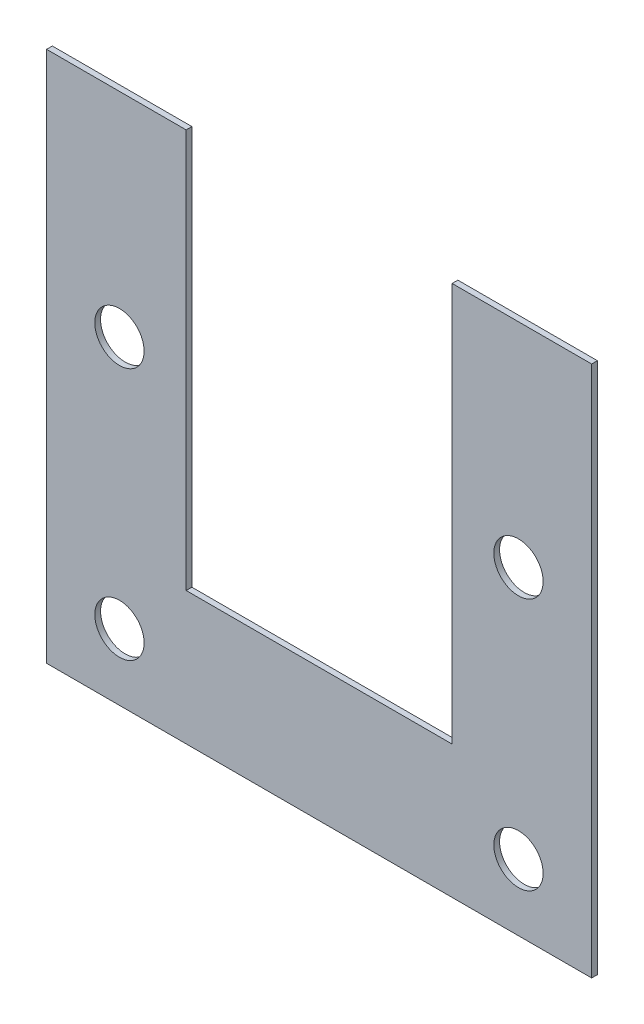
from build123d import *

# Parameters (mm, degrees)
EXTRUDE1_DEPTH       = 0.17145
HOLE1_D              = 2.9464
LPATTERN1_COUNT      = 2
LPATTERN1_PITCH      = 23.8252
LPATTERN1_COUNT_DIR2 = 2
LPATTERN1_PITCH_DIR2 = 15.0876
SKETCH5_W            = 32.54375
SKETCH5_H            = 0.79375
CUT_EXTRUDE2_DEPTH   = 24.014460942


with BuildPart() as part:
    # Sketch1 → Extrude1 (new, symmetric)
    with BuildSketch(Plane.XY):
        Polygon((-16.271875, 16.271875), (-7.940675, 16.271875), (-7.940675, -8.340725), (7.940675, -8.340725), (7.940675, 16.271875), (16.271875, 16.271875), (16.271875, -16.271875), (-16.271875, -16.271875), align=None)
    extrude(amount=EXTRUDE1_DEPTH, both=True)

    # Hole1 (through all)
    with Locations(Plane.XY.offset(0.17145)):
        with Locations((11.903075, -12.309475)):
            hole1 = Hole(HOLE1_D / 2)

    # LPattern1: Hole1 2 × 2
    with Locations(*[(-i * LPATTERN1_PITCH, j * LPATTERN1_PITCH_DIR2, 0) for i in range(LPATTERN1_COUNT) for j in range(LPATTERN1_COUNT_DIR2) if (i, j) != (0, 0)]):
        add(hole1, mode=Mode.SUBTRACT)

    # Sketch5 → Cut-Extrude2 (cut, through all)
    with BuildSketch(Plane.XY.offset(0.17145)):
        with Locations((0, 15.875)):
            Rectangle(SKETCH5_W, SKETCH5_H)
    extrude(amount=-CUT_EXTRUDE2_DEPTH, mode=Mode.SUBTRACT)


solid = part.part
